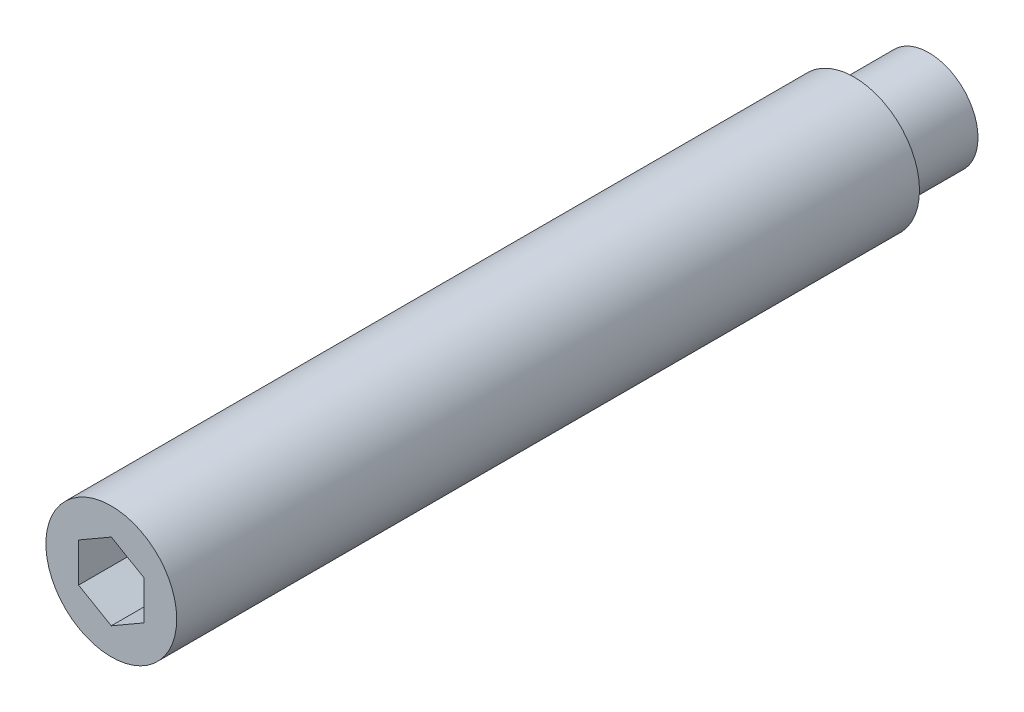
ISO-10303-21;
HEADER;
FILE_DESCRIPTION(('STEP AP214'),'2;1');
FILE_NAME('part.step','',(''),(''),'','','');
FILE_SCHEMA(('AUTOMOTIVE_DESIGN { 1 0 10303 214 1 1 1 1 }'));
ENDSEC;
DATA;
#1=APPLICATION_CONTEXT('core data for automotive mechanical design processes');
#2=APPLICATION_PROTOCOL_DEFINITION('international standard','automotive_design',2000,#1);
#3=PRODUCT_CONTEXT('',#1,'mechanical');
#4=PRODUCT('Part','Part','',(#3));
#5=PRODUCT_RELATED_PRODUCT_CATEGORY('part','',(#4));
#6=PRODUCT_DEFINITION_FORMATION('','',#4);
#7=PRODUCT_DEFINITION_CONTEXT('part definition',#1,'design');
#8=PRODUCT_DEFINITION('design','',#6,#7);
#9=PRODUCT_DEFINITION_SHAPE('','',#8);
#10=(LENGTH_UNIT() NAMED_UNIT(*) SI_UNIT(.MILLI.,.METRE.));
#11=(NAMED_UNIT(*) PLANE_ANGLE_UNIT() SI_UNIT($,.RADIAN.));
#12=(NAMED_UNIT(*) SI_UNIT($,.STERADIAN.) SOLID_ANGLE_UNIT());
#13=UNCERTAINTY_MEASURE_WITH_UNIT(LENGTH_MEASURE(1.E-05),#10,'distance_accuracy_value','');
#14=(GEOMETRIC_REPRESENTATION_CONTEXT(3) GLOBAL_UNCERTAINTY_ASSIGNED_CONTEXT((#13)) GLOBAL_UNIT_ASSIGNED_CONTEXT((#10,
#11,#12)) REPRESENTATION_CONTEXT('',''));
#15=CARTESIAN_POINT('',(0.,0.,0.));
#16=DIRECTION('',(0.,0.,1.));
#17=DIRECTION('',(1.,0.,0.));
#18=AXIS2_PLACEMENT_3D('',#15,#16,#17);
#19=CARTESIAN_POINT('',(0.,0.,110.));
#20=DIRECTION('',(0.,0.,1.));
#21=DIRECTION('',(1.,0.,0.));
#22=AXIS2_PLACEMENT_3D('',#19,#20,#21);
#23=CYLINDRICAL_SURFACE('',#22,8.);
#24=CARTESIAN_POINT('',(0.,0.,100.));
#25=DIRECTION('',(0.,0.,1.));
#26=DIRECTION('',(1.,0.,0.));
#27=AXIS2_PLACEMENT_3D('',#24,#25,#26);
#28=CIRCLE('',#27,8.);
#29=CARTESIAN_POINT('',(8.,0.,100.));
#30=VERTEX_POINT('',#29);
#31=EDGE_CURVE('E23',#30,#30,#28,.T.);
#32=ORIENTED_EDGE('',*,*,#31,.F.);
#33=EDGE_LOOP('',(#32));
#34=FACE_BOUND('',#33,.T.);
#35=CARTESIAN_POINT('',(0.,0.,9.15470053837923));
#36=DIRECTION('',(0.,0.,1.));
#37=DIRECTION('',(1.,0.,0.));
#38=AXIS2_PLACEMENT_3D('',#35,#36,#37);
#39=CIRCLE('',#38,8.);
#40=CARTESIAN_POINT('',(8.,0.,9.15470053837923));
#41=VERTEX_POINT('',#40);
#42=EDGE_CURVE('E18',#41,#41,#39,.F.);
#43=ORIENTED_EDGE('',*,*,#42,.F.);
#44=EDGE_LOOP('',(#43));
#45=FACE_BOUND('',#44,.T.);
#46=ADVANCED_FACE('F14',(#34,#45),#23,.T.);
#47=CARTESIAN_POINT('',(0.,4.7,94.));
#48=DIRECTION('',(-0.5,-0.866025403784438,0.));
#49=DIRECTION('',(0.866025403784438,-0.5,0.));
#50=AXIS2_PLACEMENT_3D('',#47,#48,#49);
#51=PLANE('',#50);
#52=DIRECTION('',(0.,0.,1.));
#53=VECTOR('',#52,1.);
#54=CARTESIAN_POINT('',(4.,2.39059892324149,94.));
#55=LINE('',#54,#53);
#56=CARTESIAN_POINT('',(4.,2.39059892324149,94.));
#57=VERTEX_POINT('',#56);
#58=CARTESIAN_POINT('',(4.,2.39059892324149,100.));
#59=VERTEX_POINT('',#58);
#60=EDGE_CURVE('E38',#57,#59,#55,.T.);
#61=ORIENTED_EDGE('',*,*,#60,.T.);
#62=DIRECTION('',(0.866025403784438,-0.5,0.));
#63=VECTOR('',#62,1.);
#64=CARTESIAN_POINT('',(0.,4.7,100.));
#65=LINE('',#64,#63);
#66=CARTESIAN_POINT('',(0.,4.7,100.));
#67=VERTEX_POINT('',#66);
#68=EDGE_CURVE('E30',#67,#59,#65,.T.);
#69=ORIENTED_EDGE('',*,*,#68,.F.);
#70=DIRECTION('',(0.,0.,1.));
#71=VECTOR('',#70,1.);
#72=CARTESIAN_POINT('',(0.,4.7,94.));
#73=LINE('',#72,#71);
#74=CARTESIAN_POINT('',(0.,4.7,94.));
#75=VERTEX_POINT('',#74);
#76=EDGE_CURVE('E94',#75,#67,#73,.T.);
#77=ORIENTED_EDGE('',*,*,#76,.F.);
#78=DIRECTION('',(0.866025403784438,-0.5,0.));
#79=VECTOR('',#78,1.);
#80=CARTESIAN_POINT('',(0.,4.7,94.));
#81=LINE('',#80,#79);
#82=EDGE_CURVE('E97',#75,#57,#81,.T.);
#83=ORIENTED_EDGE('',*,*,#82,.T.);
#84=EDGE_LOOP('',(#61,#69,#77,#83));
#85=FACE_BOUND('',#84,.T.);
#86=ADVANCED_FACE('F111',(#85),#51,.T.);
#87=CARTESIAN_POINT('',(4.,2.39059892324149,94.));
#88=DIRECTION('',(-1.,0.,0.));
#89=DIRECTION('',(0.,0.,1.));
#90=AXIS2_PLACEMENT_3D('',#87,#88,#89);
#91=PLANE('',#90);
#92=DIRECTION('',(0.,0.,1.));
#93=VECTOR('',#92,1.);
#94=CARTESIAN_POINT('',(4.,-2.39059892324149,94.));
#95=LINE('',#94,#93);
#96=CARTESIAN_POINT('',(4.,-2.39059892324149,94.));
#97=VERTEX_POINT('',#96);
#98=CARTESIAN_POINT('',(4.,-2.39059892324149,100.));
#99=VERTEX_POINT('',#98);
#100=EDGE_CURVE('E73',#97,#99,#95,.T.);
#101=ORIENTED_EDGE('',*,*,#100,.T.);
#102=DIRECTION('',(0.,-1.,0.));
#103=VECTOR('',#102,1.);
#104=CARTESIAN_POINT('',(4.,2.39059892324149,100.));
#105=LINE('',#104,#103);
#106=EDGE_CURVE('E127',#59,#99,#105,.T.);
#107=ORIENTED_EDGE('',*,*,#106,.F.);
#108=ORIENTED_EDGE('',*,*,#60,.F.);
#109=DIRECTION('',(0.,-1.,0.));
#110=VECTOR('',#109,1.);
#111=CARTESIAN_POINT('',(4.,2.39059892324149,94.));
#112=LINE('',#111,#110);
#113=EDGE_CURVE('E82',#57,#97,#112,.T.);
#114=ORIENTED_EDGE('',*,*,#113,.T.);
#115=EDGE_LOOP('',(#101,#107,#108,#114));
#116=FACE_BOUND('',#115,.T.);
#117=ADVANCED_FACE('F136',(#116),#91,.T.);
#118=CARTESIAN_POINT('',(0.,-4.7,94.));
#119=DIRECTION('',(0.5,-0.866025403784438,0.));
#120=DIRECTION('',(0.866025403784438,0.5,0.));
#121=AXIS2_PLACEMENT_3D('',#118,#119,#120);
#122=PLANE('',#121);
#123=DIRECTION('',(0.,0.,1.));
#124=VECTOR('',#123,1.);
#125=CARTESIAN_POINT('',(0.,-4.7,94.));
#126=LINE('',#125,#124);
#127=CARTESIAN_POINT('',(0.,-4.7,94.));
#128=VERTEX_POINT('',#127);
#129=CARTESIAN_POINT('',(0.,-4.7,100.));
#130=VERTEX_POINT('',#129);
#131=EDGE_CURVE('E60',#128,#130,#126,.T.);
#132=ORIENTED_EDGE('',*,*,#131,.T.);
#133=DIRECTION('',(0.866025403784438,0.5,0.));
#134=VECTOR('',#133,1.);
#135=CARTESIAN_POINT('',(0.,-4.7,100.));
#136=LINE('',#135,#134);
#137=EDGE_CURVE('E130',#130,#99,#136,.T.);
#138=ORIENTED_EDGE('',*,*,#137,.T.);
#139=ORIENTED_EDGE('',*,*,#100,.F.);
#140=DIRECTION('',(0.866025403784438,0.5,0.));
#141=VECTOR('',#140,1.);
#142=CARTESIAN_POINT('',(0.,-4.7,94.));
#143=LINE('',#142,#141);
#144=EDGE_CURVE('E77',#128,#97,#143,.T.);
#145=ORIENTED_EDGE('',*,*,#144,.F.);
#146=EDGE_LOOP('',(#132,#138,#139,#145));
#147=FACE_BOUND('',#146,.T.);
#148=ADVANCED_FACE('F78',(#147),#122,.F.);
#149=CARTESIAN_POINT('',(0.,-4.7,94.));
#150=DIRECTION('',(0.5,0.866025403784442,0.));
#151=DIRECTION('',(-0.866025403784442,0.5,0.));
#152=AXIS2_PLACEMENT_3D('',#149,#150,#151);
#153=PLANE('',#152);
#154=DIRECTION('',(0.,0.,1.));
#155=VECTOR('',#154,1.);
#156=CARTESIAN_POINT('',(-4.,-2.39059892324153,94.));
#157=LINE('',#156,#155);
#158=CARTESIAN_POINT('',(-4.,-2.39059892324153,94.));
#159=VERTEX_POINT('',#158);
#160=CARTESIAN_POINT('',(-4.,-2.39059892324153,100.));
#161=VERTEX_POINT('',#160);
#162=EDGE_CURVE('E74',#159,#161,#157,.T.);
#163=ORIENTED_EDGE('',*,*,#162,.T.);
#164=DIRECTION('',(-0.866025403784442,0.5,0.));
#165=VECTOR('',#164,1.);
#166=CARTESIAN_POINT('',(0.,-4.7,100.));
#167=LINE('',#166,#165);
#168=EDGE_CURVE('E69',#130,#161,#167,.T.);
#169=ORIENTED_EDGE('',*,*,#168,.F.);
#170=ORIENTED_EDGE('',*,*,#131,.F.);
#171=DIRECTION('',(-0.866025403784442,0.5,0.));
#172=VECTOR('',#171,1.);
#173=CARTESIAN_POINT('',(0.,-4.7,94.));
#174=LINE('',#173,#172);
#175=EDGE_CURVE('E65',#128,#159,#174,.T.);
#176=ORIENTED_EDGE('',*,*,#175,.T.);
#177=EDGE_LOOP('',(#163,#169,#170,#176));
#178=FACE_BOUND('',#177,.T.);
#179=ADVANCED_FACE('F63',(#178),#153,.T.);
#180=CARTESIAN_POINT('',(-4.,2.39059892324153,94.));
#181=DIRECTION('',(-1.,0.,0.));
#182=DIRECTION('',(0.,0.,1.));
#183=AXIS2_PLACEMENT_3D('',#180,#181,#182);
#184=PLANE('',#183);
#185=DIRECTION('',(0.,0.,1.));
#186=VECTOR('',#185,1.);
#187=CARTESIAN_POINT('',(-4.,2.39059892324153,94.));
#188=LINE('',#187,#186);
#189=CARTESIAN_POINT('',(-4.,2.39059892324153,94.));
#190=VERTEX_POINT('',#189);
#191=CARTESIAN_POINT('',(-4.,2.39059892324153,100.));
#192=VERTEX_POINT('',#191);
#193=EDGE_CURVE('E96',#190,#192,#188,.T.);
#194=ORIENTED_EDGE('',*,*,#193,.T.);
#195=DIRECTION('',(0.,-1.,0.));
#196=VECTOR('',#195,1.);
#197=CARTESIAN_POINT('',(-4.,2.39059892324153,100.));
#198=LINE('',#197,#196);
#199=EDGE_CURVE('E119',#192,#161,#198,.T.);
#200=ORIENTED_EDGE('',*,*,#199,.T.);
#201=ORIENTED_EDGE('',*,*,#162,.F.);
#202=DIRECTION('',(0.,-1.,0.));
#203=VECTOR('',#202,1.);
#204=CARTESIAN_POINT('',(-4.,2.39059892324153,94.));
#205=LINE('',#204,#203);
#206=EDGE_CURVE('E88',#190,#159,#205,.T.);
#207=ORIENTED_EDGE('',*,*,#206,.F.);
#208=EDGE_LOOP('',(#194,#200,#201,#207));
#209=FACE_BOUND('',#208,.T.);
#210=ADVANCED_FACE('F144',(#209),#184,.F.);
#211=CARTESIAN_POINT('',(0.,4.7,94.));
#212=DIRECTION('',(-0.499999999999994,0.866025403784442,0.));
#213=DIRECTION('',(-0.866025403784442,-0.499999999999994,0.));
#214=AXIS2_PLACEMENT_3D('',#211,#212,#213);
#215=PLANE('',#214);
#216=DIRECTION('',(-0.866025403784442,-0.499999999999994,0.));
#217=VECTOR('',#216,1.);
#218=CARTESIAN_POINT('',(0.,4.7,94.));
#219=LINE('',#218,#217);
#220=EDGE_CURVE('E90',#75,#190,#219,.T.);
#221=ORIENTED_EDGE('',*,*,#220,.F.);
#222=ORIENTED_EDGE('',*,*,#76,.T.);
#223=DIRECTION('',(-0.866025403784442,-0.499999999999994,0.));
#224=VECTOR('',#223,1.);
#225=CARTESIAN_POINT('',(0.,4.7,100.));
#226=LINE('',#225,#224);
#227=EDGE_CURVE('E116',#67,#192,#226,.T.);
#228=ORIENTED_EDGE('',*,*,#227,.T.);
#229=ORIENTED_EDGE('',*,*,#193,.F.);
#230=EDGE_LOOP('',(#221,#222,#228,#229));
#231=FACE_BOUND('',#230,.T.);
#232=ADVANCED_FACE('F139',(#231),#215,.F.);
#233=CARTESIAN_POINT('',(8.1406387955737,0.,94.));
#234=DIRECTION('',(0.,0.,1.));
#235=DIRECTION('',(1.,0.,0.));
#236=AXIS2_PLACEMENT_3D('',#233,#234,#235);
#237=PLANE('',#236);
#238=ORIENTED_EDGE('',*,*,#82,.F.);
#239=ORIENTED_EDGE('',*,*,#220,.T.);
#240=ORIENTED_EDGE('',*,*,#206,.T.);
#241=ORIENTED_EDGE('',*,*,#175,.F.);
#242=ORIENTED_EDGE('',*,*,#144,.T.);
#243=ORIENTED_EDGE('',*,*,#113,.F.);
#244=EDGE_LOOP('',(#238,#239,#240,#241,#242,#243));
#245=FACE_BOUND('',#244,.T.);
#246=ADVANCED_FACE('F85',(#245),#237,.T.);
#247=CARTESIAN_POINT('',(8.,0.,100.));
#248=DIRECTION('',(0.,0.,-1.));
#249=DIRECTION('',(-1.,0.,0.));
#250=AXIS2_PLACEMENT_3D('',#247,#248,#249);
#251=PLANE('',#250);
#252=ORIENTED_EDGE('',*,*,#31,.T.);
#253=EDGE_LOOP('',(#252));
#254=FACE_BOUND('',#253,.T.);
#255=ORIENTED_EDGE('',*,*,#68,.T.);
#256=ORIENTED_EDGE('',*,*,#106,.T.);
#257=ORIENTED_EDGE('',*,*,#137,.F.);
#258=ORIENTED_EDGE('',*,*,#168,.T.);
#259=ORIENTED_EDGE('',*,*,#199,.F.);
#260=ORIENTED_EDGE('',*,*,#227,.F.);
#261=EDGE_LOOP('',(#255,#256,#257,#258,#259,#260));
#262=FACE_BOUND('',#261,.T.);
#263=ADVANCED_FACE('F106',(#254,#262),#251,.F.);
#264=CARTESIAN_POINT('',(0.,0.,8.));
#265=DIRECTION('',(0.,0.,1.));
#266=DIRECTION('',(1.,0.,0.));
#267=AXIS2_PLACEMENT_3D('',#264,#265,#266);
#268=CONICAL_SURFACE('',#267,6.,1.0471975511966);
#269=CARTESIAN_POINT('',(0.,0.,8.));
#270=DIRECTION('',(0.,0.,-1.));
#271=DIRECTION('',(-1.,0.,0.));
#272=AXIS2_PLACEMENT_3D('',#269,#270,#271);
#273=CIRCLE('',#272,6.);
#274=CARTESIAN_POINT('',(-6.,0.,8.));
#275=VERTEX_POINT('',#274);
#276=EDGE_CURVE('E117',#275,#275,#273,.T.);
#277=ORIENTED_EDGE('',*,*,#276,.F.);
#278=EDGE_LOOP('',(#277));
#279=FACE_BOUND('',#278,.T.);
#280=ORIENTED_EDGE('',*,*,#42,.T.);
#281=EDGE_LOOP('',(#280));
#282=FACE_BOUND('',#281,.T.);
#283=ADVANCED_FACE('F150',(#279,#282),#268,.T.);
#284=CARTESIAN_POINT('',(0.,0.,0.));
#285=DIRECTION('',(0.,0.,1.));
#286=DIRECTION('',(1.,0.,0.));
#287=AXIS2_PLACEMENT_3D('',#284,#285,#286);
#288=PLANE('',#287);
#289=CARTESIAN_POINT('',(0.,0.,0.));
#290=DIRECTION('',(0.,0.,1.));
#291=DIRECTION('',(1.,0.,0.));
#292=AXIS2_PLACEMENT_3D('',#289,#290,#291);
#293=CIRCLE('',#292,6.);
#294=CARTESIAN_POINT('',(6.,0.,0.));
#295=VERTEX_POINT('',#294);
#296=EDGE_CURVE('E9',#295,#295,#293,.T.);
#297=ORIENTED_EDGE('',*,*,#296,.F.);
#298=EDGE_LOOP('',(#297));
#299=FACE_BOUND('',#298,.T.);
#300=ADVANCED_FACE('F16',(#299),#288,.F.);
#301=CARTESIAN_POINT('',(0.,0.,110.));
#302=DIRECTION('',(0.,0.,1.));
#303=DIRECTION('',(1.,0.,0.));
#304=AXIS2_PLACEMENT_3D('',#301,#302,#303);
#305=CYLINDRICAL_SURFACE('',#304,6.);
#306=ORIENTED_EDGE('',*,*,#276,.T.);
#307=EDGE_LOOP('',(#306));
#308=FACE_BOUND('',#307,.T.);
#309=ORIENTED_EDGE('',*,*,#296,.T.);
#310=EDGE_LOOP('',(#309));
#311=FACE_BOUND('',#310,.T.);
#312=ADVANCED_FACE('F243',(#308,#311),#305,.T.);
#313=CLOSED_SHELL('',(#46,#86,#117,#148,#179,#210,#232,#246,#263,#283,#300,#312));
#314=MANIFOLD_SOLID_BREP('B1',#313);
#315=ADVANCED_BREP_SHAPE_REPRESENTATION('',(#18,#314),#14);
#316=SHAPE_DEFINITION_REPRESENTATION(#9,#315);
ENDSEC;
END-ISO-10303-21;
